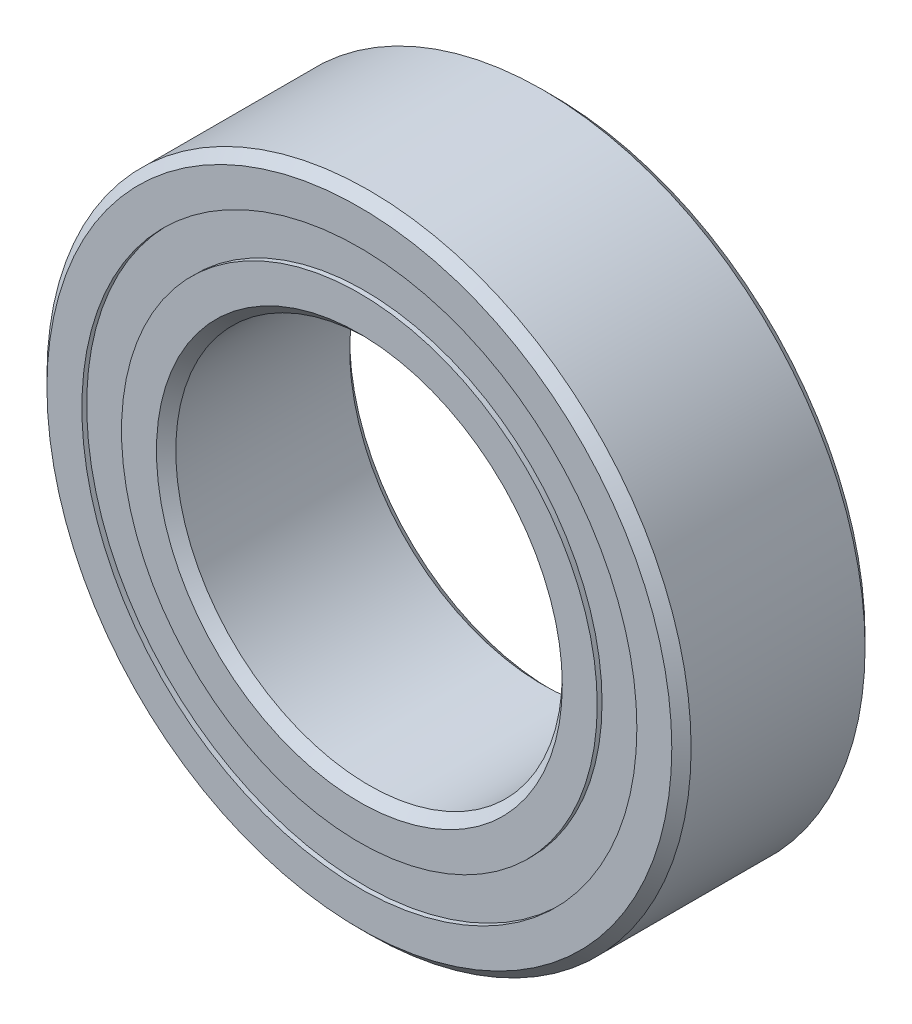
from build123d import *

# Parameters (mm, degrees)
CIRPATTERN1_COUNT = 12
SKETCH5_W         = 0.690752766
SKETCH5_H         = 0.615384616


with BuildPart() as part:
    # Sketch1 → Revolve1 (revolve)
    with BuildSketch(Plane(origin=(0, 0, 0), x_dir=(0, 0, -1), z_dir=(1, 0, 0)), mode=Mode.PRIVATE) as revolve1_sk:
        with BuildLine():
            Line((1.35, 5), (-1.35, 5))
            Line((-1.35, 5), (-1.5, 4.85))
            Line((-1.5, 4.85), (-1.5, 4.307692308))
            Line((-1.5, 4.307692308), (-0.666666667, 4.307692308))
            ThreePointArc((-0.666666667, 4.307692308), (0, 4.734247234), (0.666666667, 4.307692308))
            Line((0.666666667, 4.307692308), (1.5, 4.307692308))
            Line((1.5, 4.307692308), (1.5, 4.85))
            Line((1.5, 4.85), (1.35, 5))
        make_face()
    revolve(revolve1_sk.sketch.rotate(Axis((0, 0, 1.5), (0, 0, -1)), 90), axis=Axis((0, 0, 1.5), (0, 0, -1)))


with BuildPart() as body_2:
    # Sketch3 → Revolve3 (revolve)
    with BuildSketch(Plane(origin=(0, 0, 0), x_dir=(0, 0, -1), z_dir=(1, 0, 0)), mode=Mode.PRIVATE) as revolve3_sk:
        with BuildLine():
            Line((-1.5, 3.692307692), (-0.666666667, 3.692307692))
            ThreePointArc((-0.666666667, 3.692307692), (0, 3.265752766), (0.666666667, 3.692307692))
            Line((0.666666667, 3.692307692), (1.5, 3.692307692))
            Line((1.5, 3.692307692), (1.5, 3.15))
            Line((1.5, 3.15), (1.35, 3))
            Line((1.35, 3), (-1.35, 3))
            Line((-1.35, 3), (-1.5, 3.15))
            Line((-1.5, 3.15), (-1.5, 3.692307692))
        make_face()
    revolve(revolve3_sk.sketch.rotate(Axis((0, 0, 1.5), (0, 0, -1)), 90), axis=Axis((0, 0, 1.5), (0, 0, -1)))


with BuildPart() as body_3:
    # Sketch4 → Revolve4 (revolve)
    with BuildSketch(Plane(origin=(0, 0, 0), x_dir=(0, 0, -1), z_dir=(1, 0, 0))):
        with BuildLine():
            Line((-0.734247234, 4), (0.734247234, 4))
            ThreePointArc((0.734247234, 4), (0, 4.734247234), (-0.734247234, 4))
        make_face()
    revolve(axis=Axis((0, 4, 0.734247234), (0, 0, -1)))


with BuildPart() as cirpattern1_1:
    # CirPattern1: pattern copy
    add(body_3.part.rotate(Axis((0, 0, 0), (0, 0, 1)), 1 * 360 / CIRPATTERN1_COUNT))


with BuildPart() as cirpattern1_2:
    # CirPattern1: pattern copy
    add(body_3.part.rotate(Axis((0, 0, 0), (0, 0, 1)), 2 * 360 / CIRPATTERN1_COUNT))


with BuildPart() as cirpattern1_3:
    # CirPattern1: pattern copy
    add(body_3.part.rotate(Axis((0, 0, 0), (0, 0, 1)), 3 * 360 / CIRPATTERN1_COUNT))


with BuildPart() as cirpattern1_4:
    # CirPattern1: pattern copy
    add(body_3.part.rotate(Axis((0, 0, 0), (0, 0, 1)), 4 * 360 / CIRPATTERN1_COUNT))


with BuildPart() as cirpattern1_5:
    # CirPattern1: pattern copy
    add(body_3.part.rotate(Axis((0, 0, 0), (0, 0, 1)), 5 * 360 / CIRPATTERN1_COUNT))


with BuildPart() as cirpattern1_6:
    # CirPattern1: pattern copy
    add(body_3.part.rotate(Axis((0, 0, 0), (0, 0, 1)), 6 * 360 / CIRPATTERN1_COUNT))


with BuildPart() as cirpattern1_7:
    # CirPattern1: pattern copy
    add(body_3.part.rotate(Axis((0, 0, 0), (0, 0, 1)), 7 * 360 / CIRPATTERN1_COUNT))


with BuildPart() as cirpattern1_8:
    # CirPattern1: pattern copy
    add(body_3.part.rotate(Axis((0, 0, 0), (0, 0, 1)), 8 * 360 / CIRPATTERN1_COUNT))


with BuildPart() as cirpattern1_9:
    # CirPattern1: pattern copy
    add(body_3.part.rotate(Axis((0, 0, 0), (0, 0, 1)), 9 * 360 / CIRPATTERN1_COUNT))


with BuildPart() as cirpattern1_10:
    # CirPattern1: pattern copy
    add(body_3.part.rotate(Axis((0, 0, 0), (0, 0, 1)), 10 * 360 / CIRPATTERN1_COUNT))


with BuildPart() as cirpattern1_11:
    # CirPattern1: pattern copy
    add(body_3.part.rotate(Axis((0, 0, 0), (0, 0, 1)), 11 * 360 / CIRPATTERN1_COUNT))


with BuildPart() as body_15:
    # Sketch5 → Revolve5 (revolve)
    with BuildSketch(Plane(origin=(0, 0, 0), x_dir=(0, 0, -1), z_dir=(1, 0, 0)), mode=Mode.PRIVATE) as revolve5_sk:
        with Locations((-1.079623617, 4)):
            Rectangle(SKETCH5_W, SKETCH5_H)
        with Locations((1.079623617, 4)):
            Rectangle(SKETCH5_W, SKETCH5_H)
    revolve(revolve5_sk.sketch.rotate(Axis((0, 0, 1.5), (0, 0, -1)), 90), axis=Axis((0, 0, 1.5), (0, 0, -1)))


solid = Compound([part.part, body_2.part, body_3.part, cirpattern1_1.part, cirpattern1_2.part, cirpattern1_3.part, cirpattern1_4.part, cirpattern1_5.part, cirpattern1_6.part, cirpattern1_7.part, cirpattern1_8.part, cirpattern1_9.part, cirpattern1_10.part, cirpattern1_11.part, body_15.part])
